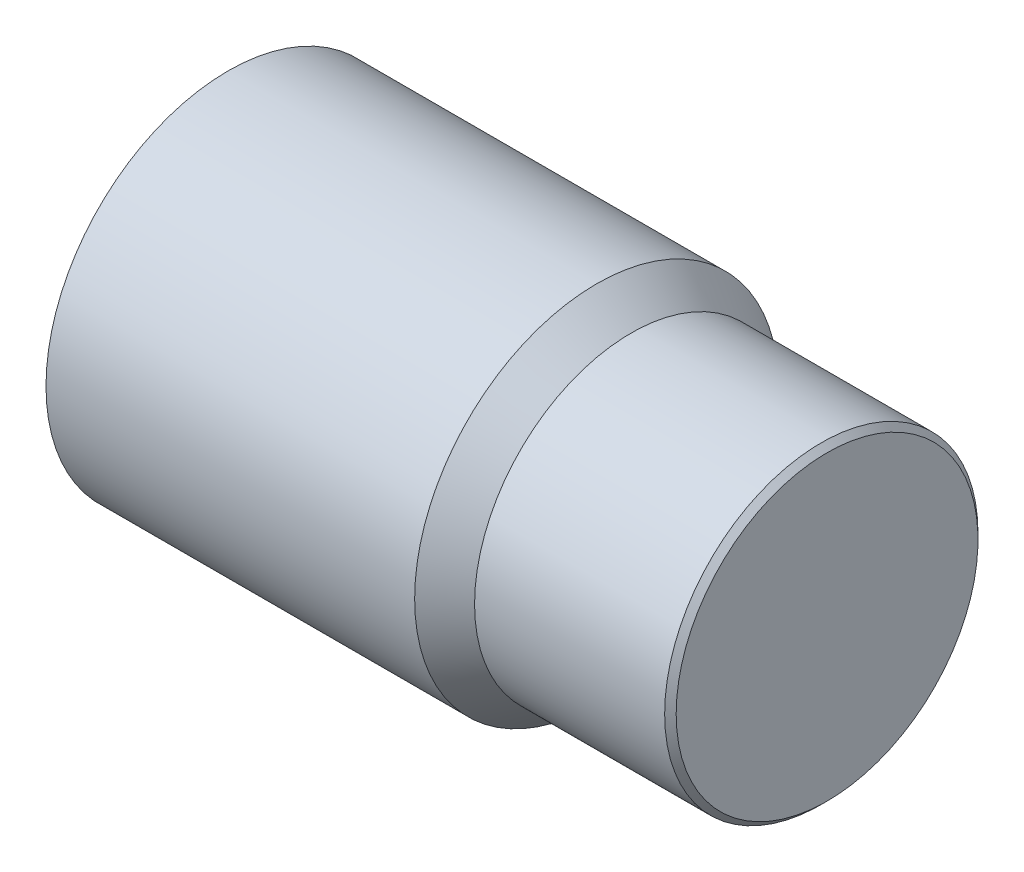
ISO-10303-21;
HEADER;
FILE_DESCRIPTION(('STEP AP214'),'2;1');
FILE_NAME('part.step','',(''),(''),'','','');
FILE_SCHEMA(('AUTOMOTIVE_DESIGN { 1 0 10303 214 1 1 1 1 }'));
ENDSEC;
DATA;
#1=APPLICATION_CONTEXT('core data for automotive mechanical design processes');
#2=APPLICATION_PROTOCOL_DEFINITION('international standard','automotive_design',2000,#1);
#3=PRODUCT_CONTEXT('',#1,'mechanical');
#4=PRODUCT('Part','Part','',(#3));
#5=PRODUCT_RELATED_PRODUCT_CATEGORY('part','',(#4));
#6=PRODUCT_DEFINITION_FORMATION('','',#4);
#7=PRODUCT_DEFINITION_CONTEXT('part definition',#1,'design');
#8=PRODUCT_DEFINITION('design','',#6,#7);
#9=PRODUCT_DEFINITION_SHAPE('','',#8);
#10=(LENGTH_UNIT() NAMED_UNIT(*) SI_UNIT(.MILLI.,.METRE.));
#11=(NAMED_UNIT(*) PLANE_ANGLE_UNIT() SI_UNIT($,.RADIAN.));
#12=(NAMED_UNIT(*) SI_UNIT($,.STERADIAN.) SOLID_ANGLE_UNIT());
#13=UNCERTAINTY_MEASURE_WITH_UNIT(LENGTH_MEASURE(1.E-05),#10,'distance_accuracy_value','');
#14=(GEOMETRIC_REPRESENTATION_CONTEXT(3) GLOBAL_UNCERTAINTY_ASSIGNED_CONTEXT((#13)) GLOBAL_UNIT_ASSIGNED_CONTEXT((#10,
#11,#12)) REPRESENTATION_CONTEXT('',''));
#15=CARTESIAN_POINT('',(0.,0.,0.));
#16=DIRECTION('',(0.,0.,1.));
#17=DIRECTION('',(1.,0.,0.));
#18=AXIS2_PLACEMENT_3D('',#15,#16,#17);
#19=CARTESIAN_POINT('',(8.,0.,0.));
#20=DIRECTION('',(-1.,0.,0.));
#21=DIRECTION('',(0.,0.,1.));
#22=AXIS2_PLACEMENT_3D('',#19,#20,#21);
#23=CYLINDRICAL_SURFACE('',#22,3.95);
#24=CARTESIAN_POINT('',(8.,0.,0.));
#25=DIRECTION('',(1.,0.,0.));
#26=DIRECTION('',(0.,0.,-1.));
#27=AXIS2_PLACEMENT_3D('',#24,#25,#26);
#28=CIRCLE('',#27,3.95);
#29=CARTESIAN_POINT('',(8.,0.,-3.95));
#30=VERTEX_POINT('',#29);
#31=EDGE_CURVE('E50',#30,#30,#28,.T.);
#32=ORIENTED_EDGE('',*,*,#31,.F.);
#33=EDGE_LOOP('',(#32));
#34=FACE_BOUND('',#33,.T.);
#35=CARTESIAN_POINT('',(0.,0.,0.));
#36=DIRECTION('',(1.,0.,0.));
#37=DIRECTION('',(0.,0.,-1.));
#38=AXIS2_PLACEMENT_3D('',#35,#36,#37);
#39=CIRCLE('',#38,3.95);
#40=CARTESIAN_POINT('',(0.,0.,-3.95));
#41=VERTEX_POINT('',#40);
#42=EDGE_CURVE('E55',#41,#41,#39,.T.);
#43=ORIENTED_EDGE('',*,*,#42,.T.);
#44=EDGE_LOOP('',(#43));
#45=FACE_BOUND('',#44,.T.);
#46=ADVANCED_FACE('F37',(#34,#45),#23,.T.);
#47=CARTESIAN_POINT('',(0.,0.,0.));
#48=DIRECTION('',(1.,0.,0.));
#49=DIRECTION('',(0.,0.,-1.));
#50=AXIS2_PLACEMENT_3D('',#47,#48,#49);
#51=PLANE('',#50);
#52=ORIENTED_EDGE('',*,*,#42,.F.);
#53=EDGE_LOOP('',(#52));
#54=FACE_BOUND('',#53,.T.);
#55=ADVANCED_FACE('F80',(#54),#51,.F.);
#56=CARTESIAN_POINT('',(8.,0.,0.));
#57=DIRECTION('',(-1.,0.,0.));
#58=DIRECTION('',(0.,0.,1.));
#59=AXIS2_PLACEMENT_3D('',#56,#57,#58);
#60=CONICAL_SURFACE('',#59,3.95,0.632748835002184);
#61=CARTESIAN_POINT('',(8.75,0.,0.));
#62=DIRECTION('',(-1.,0.,0.));
#63=DIRECTION('',(0.,0.,1.));
#64=AXIS2_PLACEMENT_3D('',#61,#62,#63);
#65=CIRCLE('',#64,3.4);
#66=CARTESIAN_POINT('',(8.75,0.,3.4));
#67=VERTEX_POINT('',#66);
#68=EDGE_CURVE('E60',#67,#67,#65,.T.);
#69=ORIENTED_EDGE('',*,*,#68,.T.);
#70=EDGE_LOOP('',(#69));
#71=FACE_BOUND('',#70,.T.);
#72=ORIENTED_EDGE('',*,*,#31,.T.);
#73=EDGE_LOOP('',(#72));
#74=FACE_BOUND('',#73,.T.);
#75=ADVANCED_FACE('F66',(#71,#74),#60,.T.);
#76=CARTESIAN_POINT('',(13.,0.,0.));
#77=DIRECTION('',(-1.,0.,0.));
#78=DIRECTION('',(0.,0.,1.));
#79=AXIS2_PLACEMENT_3D('',#76,#77,#78);
#80=PLANE('',#79);
#81=CARTESIAN_POINT('',(13.,0.,0.));
#82=DIRECTION('',(-1.,0.,0.));
#83=DIRECTION('',(0.,0.,1.));
#84=AXIS2_PLACEMENT_3D('',#81,#82,#83);
#85=CIRCLE('',#84,3.275);
#86=CARTESIAN_POINT('',(13.,0.,3.275));
#87=VERTEX_POINT('',#86);
#88=EDGE_CURVE('E10',#87,#87,#85,.F.);
#89=ORIENTED_EDGE('',*,*,#88,.T.);
#90=EDGE_LOOP('',(#89));
#91=FACE_BOUND('',#90,.T.);
#92=ADVANCED_FACE('F71',(#91),#80,.F.);
#93=CARTESIAN_POINT('',(8.,0.,0.));
#94=DIRECTION('',(-1.,0.,0.));
#95=DIRECTION('',(0.,0.,1.));
#96=AXIS2_PLACEMENT_3D('',#93,#94,#95);
#97=CYLINDRICAL_SURFACE('',#96,3.4);
#98=CARTESIAN_POINT('',(12.875,0.,0.));
#99=DIRECTION('',(-1.,0.,0.));
#100=DIRECTION('',(0.,0.,1.));
#101=AXIS2_PLACEMENT_3D('',#98,#99,#100);
#102=CIRCLE('',#101,3.4);
#103=CARTESIAN_POINT('',(12.875,0.,3.4));
#104=VERTEX_POINT('',#103);
#105=EDGE_CURVE('E45',#104,#104,#102,.T.);
#106=ORIENTED_EDGE('',*,*,#105,.T.);
#107=EDGE_LOOP('',(#106));
#108=FACE_BOUND('',#107,.T.);
#109=ORIENTED_EDGE('',*,*,#68,.F.);
#110=EDGE_LOOP('',(#109));
#111=FACE_BOUND('',#110,.T.);
#112=ADVANCED_FACE('F69',(#108,#111),#97,.T.);
#113=CARTESIAN_POINT('',(12.875,0.,0.));
#114=DIRECTION('',(-1.,0.,0.));
#115=DIRECTION('',(0.,0.,1.));
#116=AXIS2_PLACEMENT_3D('',#113,#114,#115);
#117=CONICAL_SURFACE('',#116,3.4,0.78539816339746);
#118=ORIENTED_EDGE('',*,*,#88,.F.);
#119=EDGE_LOOP('',(#118));
#120=FACE_BOUND('',#119,.T.);
#121=ORIENTED_EDGE('',*,*,#105,.F.);
#122=EDGE_LOOP('',(#121));
#123=FACE_BOUND('',#122,.T.);
#124=ADVANCED_FACE('F39',(#120,#123),#117,.T.);
#125=CLOSED_SHELL('',(#46,#55,#75,#92,#112,#124));
#126=MANIFOLD_SOLID_BREP('B2',#125);
#127=ADVANCED_BREP_SHAPE_REPRESENTATION('',(#18,#126),#14);
#128=SHAPE_DEFINITION_REPRESENTATION(#9,#127);
ENDSEC;
END-ISO-10303-21;
